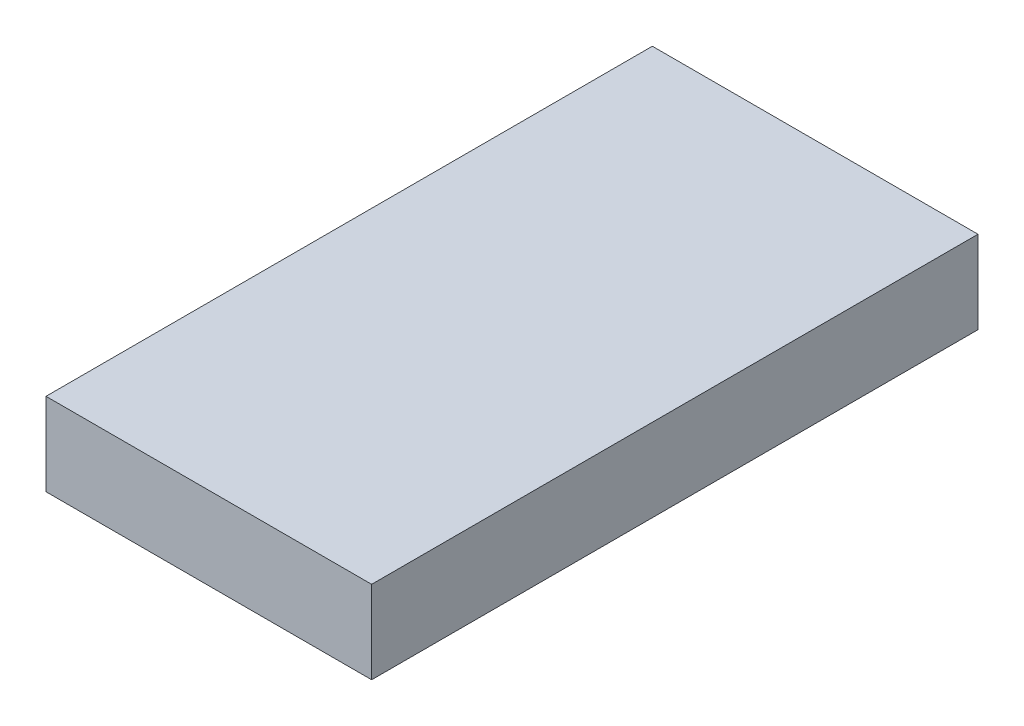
from build123d import *

# Parameters (mm, degrees)
SKETCH1_W      = 600.2
SKETCH1_H      = 1117.6
EXTRUDE1_DEPTH = 152.4


with BuildPart() as part:
    # Sketch1 → Extrude1 (new body)
    with BuildSketch(Plane(origin=(0, 0, 0), x_dir=(1, 0, 0), z_dir=(0, 1, 0))):
        with Locations((300.1, 558.8)):
            Rectangle(SKETCH1_W, SKETCH1_H)
    extrude(amount=EXTRUDE1_DEPTH)


solid = part.part
